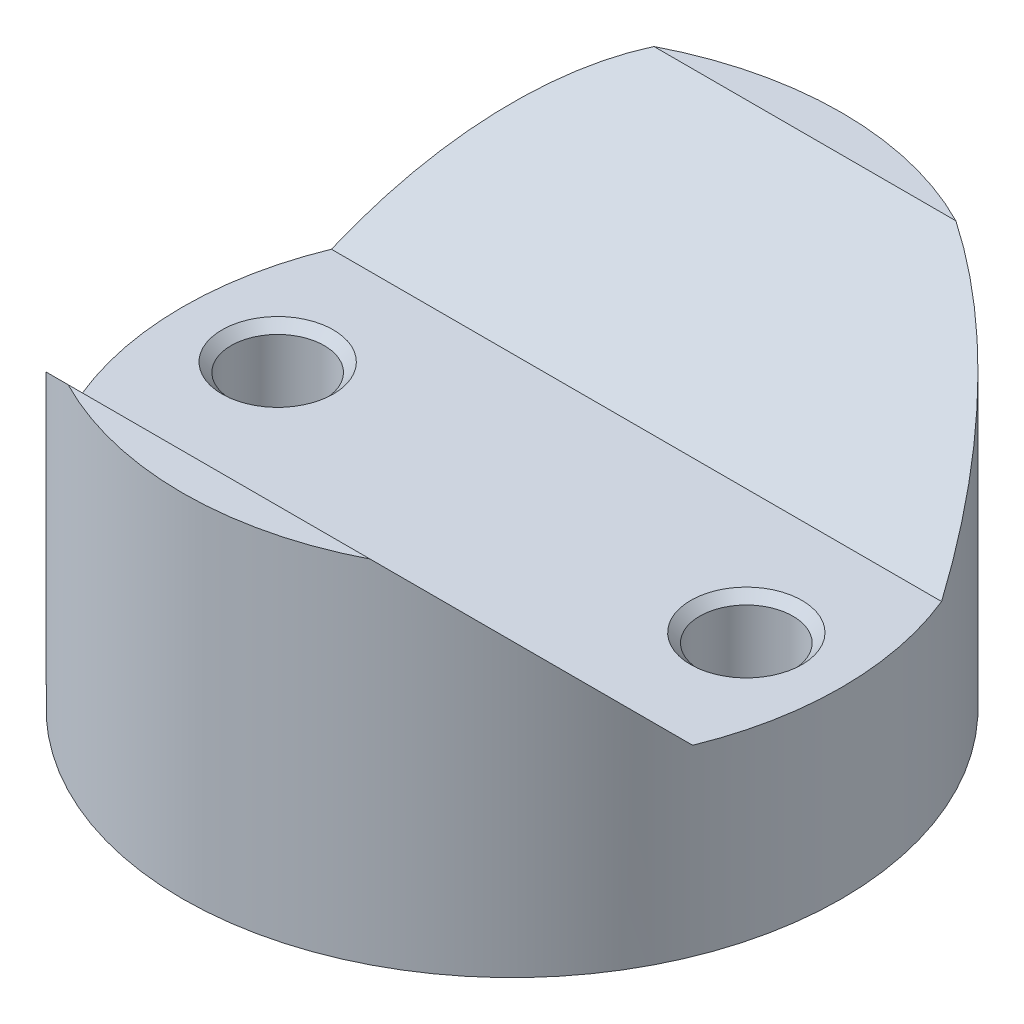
from build123d import *

# Parameters (mm, degrees)
SKETCH1_R               = 14.2875
EXTRUDE1_DEPTH          = 15.24
CUT_EXTRUDE1_DEPTH      = 26.308554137
CUT_EXTRUDE1_DEPTH_BACK = 26.308554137
TAP_DRILL_FOR_10_TAP1_D = 4.0386
CHAMFER1_SIZE           = 0.3937
SKETCH6_R               = 6.35
CUT_EXTRUDE2_DEPTH      = 0.635


with BuildPart() as part:
    # Sketch1 → Extrude1 (new body)
    with BuildSketch(Plane(origin=(0, 0, 0), x_dir=(1, 0, 0), z_dir=(0, 1, 0))):
        with Locations(Location((0, 0, 0), (0, 0, 90))):
            Circle(SKETCH1_R)
    extrude(amount=EXTRUDE1_DEPTH)

    # Sketch3 → Cut-Extrude1 (cut, two sides: drawn at the far end of the back side and taken through both)
    with BuildSketch(Plane(origin=(0, 0, 0), x_dir=(0, 0, -1), z_dir=(1, 0, 0)).offset(-CUT_EXTRUDE1_DEPTH_BACK)):
        Polygon((-12.7, 15.24), (12.7, 15.24), (5.3975, 7.9375), (-5.3975, 7.9375), align=None)
    extrude(amount=CUT_EXTRUDE1_DEPTH + CUT_EXTRUDE1_DEPTH_BACK, mode=Mode.SUBTRACT)

    # Tap Drill for _10 Tap1 (through all)
    with Locations(Plane.XZ):
        with Locations((-10.16, 0), (10.16, 0)):
            Hole(TAP_DRILL_FOR_10_TAP1_D / 2)

    # Chamfer1
    chamfer1_edges = [part.edges().sort_by_distance(p)[0] for p in [
        (12.1793, 7.9375, 0),
        (12.1793, 0, 0),
        (-8.1407, 7.9375, 0),
        (-8.1407, 0, 0),
    ]]
    chamfer(chamfer1_edges, length=CHAMFER1_SIZE)

    # Sketch6 → Cut-Extrude2 (cut)
    with BuildSketch(Plane.XZ):
        with Locations(Location((0, 0, 0), (0, 0, 270))):
            Circle(SKETCH6_R)
    extrude(amount=-CUT_EXTRUDE2_DEPTH, mode=Mode.SUBTRACT)


solid = part.part
